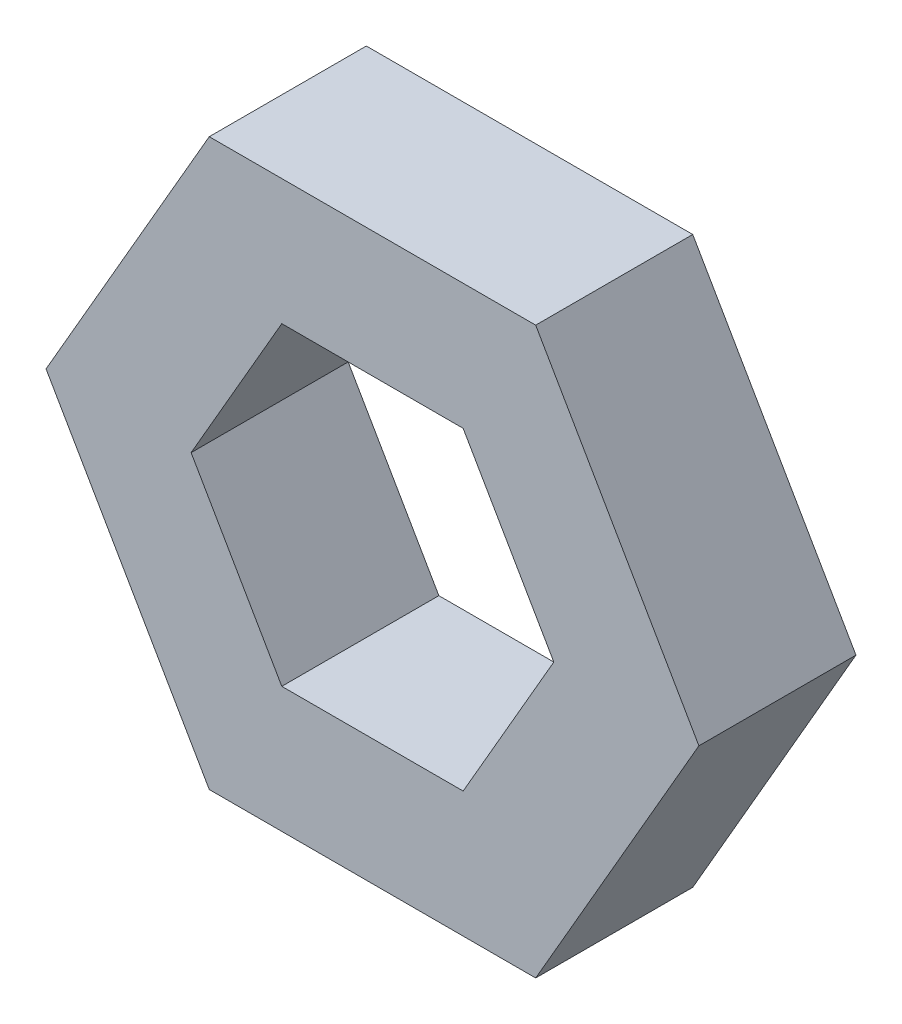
from build123d import *

# Parameters (mm, degrees)
BOSS_EXTRUDE1_DEPTH = 3.175


with BuildPart() as part:
    # Sketch1 → Boss-Extrude1 (new body)
    with BuildSketch(Plane.XY):
        Polygon((6.599113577, 0), (3.299556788, 5.715), (-3.299556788, 5.715), (-6.599113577, 0), (-3.299556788, -5.715), (3.299556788, -5.715), align=None)
        Polygon((3.666174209, 0), (1.833087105, 3.175), (-1.833087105, 3.175), (-3.666174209, 0), (-1.833087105, -3.175), (1.833087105, -3.175), align=None, mode=Mode.SUBTRACT)
    extrude(amount=BOSS_EXTRUDE1_DEPTH)


solid = part.part
